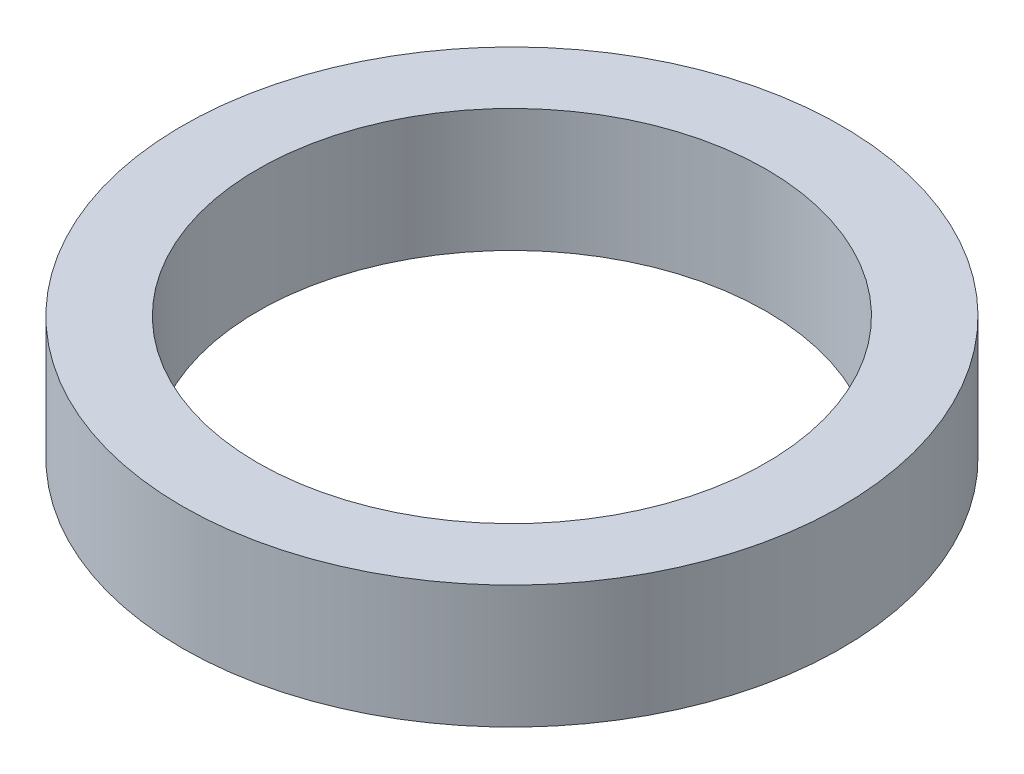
from build123d import *

# Parameters (mm, degrees)
SKETCH1_R           = 13.13
SKETCH1_R_2         = 10.13
BOSS_EXTRUDE1_DEPTH = 4.9


with BuildPart() as part:
    # Sketch1 → Boss-Extrude1 (new body)
    with BuildSketch(Plane(origin=(0, 0, 0), x_dir=(1, 0, 0), z_dir=(0, 1, 0))):
        with Locations(Location((0, 0, 0), (0, 0, 270))):
            Circle(SKETCH1_R)
        with Locations(Location((0, 0, 0), (0, 0, 270))):
            Circle(SKETCH1_R_2, mode=Mode.SUBTRACT)
    extrude(amount=BOSS_EXTRUDE1_DEPTH)


solid = part.part
